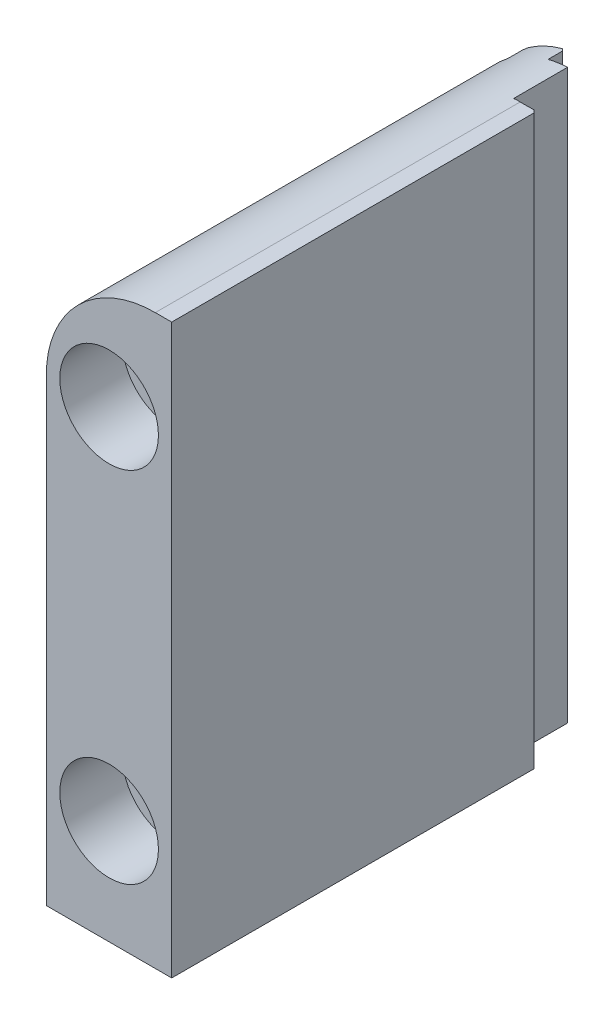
ISO-10303-21;
HEADER;
FILE_DESCRIPTION(('STEP AP214'),'2;1');
FILE_NAME('part.step','',(''),(''),'','','');
FILE_SCHEMA(('AUTOMOTIVE_DESIGN { 1 0 10303 214 1 1 1 1 }'));
ENDSEC;
DATA;
#1=APPLICATION_CONTEXT('core data for automotive mechanical design processes');
#2=APPLICATION_PROTOCOL_DEFINITION('international standard','automotive_design',2000,#1);
#3=PRODUCT_CONTEXT('',#1,'mechanical');
#4=PRODUCT('Part','Part','',(#3));
#5=PRODUCT_RELATED_PRODUCT_CATEGORY('part','',(#4));
#6=PRODUCT_DEFINITION_FORMATION('','',#4);
#7=PRODUCT_DEFINITION_CONTEXT('part definition',#1,'design');
#8=PRODUCT_DEFINITION('design','',#6,#7);
#9=PRODUCT_DEFINITION_SHAPE('','',#8);
#10=(LENGTH_UNIT() NAMED_UNIT(*) SI_UNIT(.MILLI.,.METRE.));
#11=(NAMED_UNIT(*) PLANE_ANGLE_UNIT() SI_UNIT($,.RADIAN.));
#12=(NAMED_UNIT(*) SI_UNIT($,.STERADIAN.) SOLID_ANGLE_UNIT());
#13=UNCERTAINTY_MEASURE_WITH_UNIT(LENGTH_MEASURE(1.E-05),#10,'distance_accuracy_value','');
#14=(GEOMETRIC_REPRESENTATION_CONTEXT(3) GLOBAL_UNCERTAINTY_ASSIGNED_CONTEXT((#13)) GLOBAL_UNIT_ASSIGNED_CONTEXT((#10,
#11,#12)) REPRESENTATION_CONTEXT('',''));
#15=CARTESIAN_POINT('',(0.,0.,0.));
#16=DIRECTION('',(0.,0.,1.));
#17=DIRECTION('',(1.,0.,0.));
#18=AXIS2_PLACEMENT_3D('',#15,#16,#17);
#19=CARTESIAN_POINT('',(-7.32028,25.146,-37.084));
#20=DIRECTION('',(0.,0.,-1.));
#21=DIRECTION('',(1.,0.,0.));
#22=AXIS2_PLACEMENT_3D('',#19,#20,#21);
#23=PLANE('',#22);
#24=CARTESIAN_POINT('',(-5.54228,-15.875,-37.084));
#25=DIRECTION('',(0.,0.,-1.));
#26=DIRECTION('',(-1.,0.,0.));
#27=AXIS2_PLACEMENT_3D('',#24,#25,#26);
#28=CIRCLE('',#27,2.7051);
#29=CARTESIAN_POINT('',(-8.24738,-15.875,-37.084));
#30=VERTEX_POINT('',#29);
#31=EDGE_CURVE('E319',#30,#30,#28,.T.);
#32=ORIENTED_EDGE('',*,*,#31,.F.);
#33=EDGE_LOOP('',(#32));
#34=FACE_BOUND('',#33,.T.);
#35=CARTESIAN_POINT('',(-5.54228,15.875,-37.084));
#36=DIRECTION('',(0.,0.,-1.));
#37=DIRECTION('',(-1.,0.,0.));
#38=AXIS2_PLACEMENT_3D('',#35,#36,#37);
#39=CIRCLE('',#38,2.7051);
#40=CARTESIAN_POINT('',(-8.24738,15.875,-37.084));
#41=VERTEX_POINT('',#40);
#42=EDGE_CURVE('E300',#41,#41,#39,.T.);
#43=ORIENTED_EDGE('',*,*,#42,.F.);
#44=EDGE_LOOP('',(#43));
#45=FACE_BOUND('',#44,.T.);
#46=DIRECTION('',(-0.999999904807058,0.000436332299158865,0.));
#47=VECTOR('',#46,1.);
#48=CARTESIAN_POINT('',(-7.32432489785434,15.8757775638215,-37.084));
#49=LINE('',#48,#47);
#50=CARTESIAN_POINT('',(-2.36702630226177,15.8736145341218,-37.084));
#51=VERTEX_POINT('',#50);
#52=CARTESIAN_POINT('',(-2.3672803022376,15.8736146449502,-37.084));
#53=VERTEX_POINT('',#52);
#54=EDGE_CURVE('E252',#51,#53,#49,.T.);
#55=ORIENTED_EDGE('',*,*,#54,.T.);
#56=CARTESIAN_POINT('',(-5.54228,15.875,-37.084));
#57=DIRECTION('',(0.,0.,1.));
#58=DIRECTION('',(1.,0.,0.));
#59=AXIS2_PLACEMENT_3D('',#56,#57,#58);
#60=CIRCLE('',#59,3.175);
#61=CARTESIAN_POINT('',(-2.36728,15.875,-37.084));
#62=VERTEX_POINT('',#61);
#63=EDGE_CURVE('E324',#62,#53,#60,.T.);
#64=ORIENTED_EDGE('',*,*,#63,.F.);
#65=DIRECTION('',(-1.,0.,0.));
#66=VECTOR('',#65,1.);
#67=CARTESIAN_POINT('',(-7.32028,15.875,-37.084));
#68=LINE('',#67,#66);
#69=CARTESIAN_POINT('',(-2.367026,15.875,-37.084));
#70=VERTEX_POINT('',#69);
#71=EDGE_CURVE('E381',#62,#70,#68,.F.);
#72=ORIENTED_EDGE('',*,*,#71,.T.);
#73=CARTESIAN_POINT('',(-5.54228,15.875,-37.084));
#74=DIRECTION('',(0.,0.,-1.));
#75=DIRECTION('',(-1.,0.,0.));
#76=AXIS2_PLACEMENT_3D('',#73,#74,#75);
#77=CIRCLE('',#76,3.175254);
#78=CARTESIAN_POINT('',(-3.76428,18.5057706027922,-37.084));
#79=VERTEX_POINT('',#78);
#80=EDGE_CURVE('E390',#79,#70,#77,.T.);
#81=ORIENTED_EDGE('',*,*,#80,.F.);
#82=DIRECTION('',(0.,-1.,0.));
#83=VECTOR('',#82,1.);
#84=CARTESIAN_POINT('',(-3.76428,25.146,-37.084));
#85=LINE('',#84,#83);
#86=CARTESIAN_POINT('',(-3.76428,24.8651543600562,-37.084));
#87=VERTEX_POINT('',#86);
#88=EDGE_CURVE('E261',#87,#79,#85,.T.);
#89=ORIENTED_EDGE('',*,*,#88,.F.);
#90=CARTESIAN_POINT('',(-1.45288,15.494,-37.084));
#91=DIRECTION('',(0.,0.,1.));
#92=DIRECTION('',(1.,0.,0.));
#93=AXIS2_PLACEMENT_3D('',#90,#91,#92);
#94=CIRCLE('',#93,9.652);
#95=CARTESIAN_POINT('',(-2.032,25.1286107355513,-37.084));
#96=VERTEX_POINT('',#95);
#97=EDGE_CURVE('E637',#96,#87,#94,.T.);
#98=ORIENTED_EDGE('',*,*,#97,.F.);
#99=DIRECTION('',(0.,-1.,0.));
#100=VECTOR('',#99,1.);
#101=CARTESIAN_POINT('',(-2.02438,25.146,-37.084));
#102=LINE('',#101,#100);
#103=CARTESIAN_POINT('',(-2.02438,-25.146,-37.084));
#104=VERTEX_POINT('',#103);
#105=EDGE_CURVE('E547',#96,#104,#102,.T.);
#106=ORIENTED_EDGE('',*,*,#105,.T.);
#107=DIRECTION('',(-1.,0.,0.));
#108=VECTOR('',#107,1.);
#109=CARTESIAN_POINT('',(-1.96088,-25.146,-37.084));
#110=LINE('',#109,#108);
#111=CARTESIAN_POINT('',(-3.76428,-25.146,-37.084));
#112=VERTEX_POINT('',#111);
#113=EDGE_CURVE('E310',#104,#112,#110,.T.);
#114=ORIENTED_EDGE('',*,*,#113,.T.);
#115=CARTESIAN_POINT('',(-3.76428,-18.5057706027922,-37.084));
#116=VERTEX_POINT('',#115);
#117=EDGE_CURVE('E262',#116,#112,#85,.T.);
#118=ORIENTED_EDGE('',*,*,#117,.F.);
#119=CARTESIAN_POINT('',(-5.54228,-15.875,-37.084));
#120=DIRECTION('',(0.,0.,-1.));
#121=DIRECTION('',(-1.,0.,0.));
#122=AXIS2_PLACEMENT_3D('',#119,#120,#121);
#123=CIRCLE('',#122,3.175254);
#124=CARTESIAN_POINT('',(-2.36702630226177,-15.8763854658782,-37.084));
#125=VERTEX_POINT('',#124);
#126=EDGE_CURVE('E359',#125,#116,#123,.T.);
#127=ORIENTED_EDGE('',*,*,#126,.F.);
#128=DIRECTION('',(-0.999999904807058,0.000436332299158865,0.));
#129=VECTOR('',#128,1.);
#130=CARTESIAN_POINT('',(-7.33817844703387,-15.874216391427,-37.084));
#131=LINE('',#130,#129);
#132=CARTESIAN_POINT('',(-2.3672803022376,-15.8763853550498,-37.084));
#133=VERTEX_POINT('',#132);
#134=EDGE_CURVE('E339',#125,#133,#131,.T.);
#135=ORIENTED_EDGE('',*,*,#134,.T.);
#136=CARTESIAN_POINT('',(-5.54228,-15.875,-37.084));
#137=DIRECTION('',(0.,0.,1.));
#138=DIRECTION('',(1.,0.,0.));
#139=AXIS2_PLACEMENT_3D('',#136,#137,#138);
#140=CIRCLE('',#139,3.175);
#141=CARTESIAN_POINT('',(-2.36728,-15.875,-37.084));
#142=VERTEX_POINT('',#141);
#143=EDGE_CURVE('E322',#142,#133,#140,.T.);
#144=ORIENTED_EDGE('',*,*,#143,.F.);
#145=DIRECTION('',(-1.,0.,0.));
#146=VECTOR('',#145,1.);
#147=CARTESIAN_POINT('',(-7.32028,-15.875,-37.084));
#148=LINE('',#147,#146);
#149=CARTESIAN_POINT('',(-2.367026,-15.875,-37.084));
#150=VERTEX_POINT('',#149);
#151=EDGE_CURVE('E336',#142,#150,#148,.F.);
#152=ORIENTED_EDGE('',*,*,#151,.T.);
#153=CARTESIAN_POINT('',(-3.76428,-13.2442293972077,-37.084));
#154=VERTEX_POINT('',#153);
#155=EDGE_CURVE('E342',#154,#150,#123,.T.);
#156=ORIENTED_EDGE('',*,*,#155,.F.);
#157=CARTESIAN_POINT('',(-3.76428,13.2442293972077,-37.084));
#158=VERTEX_POINT('',#157);
#159=EDGE_CURVE('E259',#158,#154,#85,.T.);
#160=ORIENTED_EDGE('',*,*,#159,.F.);
#161=EDGE_CURVE('E385',#51,#158,#77,.T.);
#162=ORIENTED_EDGE('',*,*,#161,.F.);
#163=EDGE_LOOP('',(#55,#64,#72,#81,#89,#98,#106,#114,#118,#127,#135,#144,#152,#156,#160,#162));
#164=FACE_BOUND('',#163,.T.);
#165=ADVANCED_FACE('F15',(#34,#45,#164),#23,.T.);
#166=CARTESIAN_POINT('',(-5.54228,15.875,-26.6446));
#167=DIRECTION('',(0.,0.,1.));
#168=DIRECTION('',(1.,0.,0.));
#169=AXIS2_PLACEMENT_3D('',#166,#167,#168);
#170=CONICAL_SURFACE('',#169,3.3147,0.785398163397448);
#171=CARTESIAN_POINT('',(-5.54228,15.875,-27.2542));
#172=DIRECTION('',(0.,0.,1.));
#173=DIRECTION('',(1.,0.,0.));
#174=AXIS2_PLACEMENT_3D('',#171,#172,#173);
#175=CIRCLE('',#174,2.7051);
#176=CARTESIAN_POINT('',(-2.83718,15.875,-27.2542));
#177=VERTEX_POINT('',#176);
#178=EDGE_CURVE('E568',#177,#177,#175,.T.);
#179=ORIENTED_EDGE('',*,*,#178,.F.);
#180=EDGE_LOOP('',(#179));
#181=FACE_BOUND('',#180,.T.);
#182=CARTESIAN_POINT('',(-5.54228,15.875,-26.6446));
#183=DIRECTION('',(0.,0.,-1.));
#184=DIRECTION('',(-1.,0.,0.));
#185=AXIS2_PLACEMENT_3D('',#182,#183,#184);
#186=CIRCLE('',#185,3.3147);
#187=CARTESIAN_POINT('',(-8.85698,15.875,-26.6446));
#188=VERTEX_POINT('',#187);
#189=EDGE_CURVE('E327',#188,#188,#186,.T.);
#190=ORIENTED_EDGE('',*,*,#189,.F.);
#191=EDGE_LOOP('',(#190));
#192=FACE_BOUND('',#191,.T.);
#193=CARTESIAN_POINT('',(-5.54228,15.875,-26.7843));
#194=DIRECTION('',(0.,0.,1.));
#195=DIRECTION('',(1.,0.,0.));
#196=AXIS2_PLACEMENT_3D('',#193,#194,#195);
#197=CIRCLE('',#196,3.175);
#198=CARTESIAN_POINT('',(-2.3672803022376,15.8736146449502,-26.7843));
#199=VERTEX_POINT('',#198);
#200=CARTESIAN_POINT('',(-2.36728,15.875,-26.7843));
#201=VERTEX_POINT('',#200);
#202=EDGE_CURVE('E9',#199,#201,#197,.F.);
#203=ORIENTED_EDGE('',*,*,#202,.F.);
#204=DIRECTION('',(0.707106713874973,-0.000308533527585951,0.707106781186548));
#205=VECTOR('',#204,1.);
#206=CARTESIAN_POINT('',(-5.54228,15.875,-29.9593));
#207=LINE('',#206,#205);
#208=CARTESIAN_POINT('',(-2.36702630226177,15.8736145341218,-26.784046));
#209=VERTEX_POINT('',#208);
#210=EDGE_CURVE('E244',#209,#199,#207,.F.);
#211=ORIENTED_EDGE('',*,*,#210,.F.);
#212=CARTESIAN_POINT('',(-5.54228,15.875,-26.784046));
#213=DIRECTION('',(0.,0.,1.));
#214=DIRECTION('',(1.,0.,0.));
#215=AXIS2_PLACEMENT_3D('',#212,#213,#214);
#216=CIRCLE('',#215,3.175254);
#217=CARTESIAN_POINT('',(-2.367026,15.875,-26.784046));
#218=VERTEX_POINT('',#217);
#219=EDGE_CURVE('E236',#209,#218,#216,.F.);
#220=ORIENTED_EDGE('',*,*,#219,.T.);
#221=DIRECTION('',(0.707106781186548,0.,0.707106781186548));
#222=VECTOR('',#221,1.);
#223=CARTESIAN_POINT('',(-5.54228,15.875,-29.9593));
#224=LINE('',#223,#222);
#225=EDGE_CURVE('E25',#201,#218,#224,.T.);
#226=ORIENTED_EDGE('',*,*,#225,.F.);
#227=EDGE_LOOP('',(#203,#211,#220,#226));
#228=FACE_BOUND('',#227,.T.);
#229=ADVANCED_FACE('F255',(#181,#192,#228),#170,.F.);
#230=CARTESIAN_POINT('',(-7.32028,13.2442293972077,-37.084));
#231=VERTEX_POINT('',#230);
#232=CARTESIAN_POINT('',(-7.32028,18.5057706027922,-37.084));
#233=VERTEX_POINT('',#232);
#234=EDGE_CURVE('E401',#231,#233,#77,.T.);
#235=ORIENTED_EDGE('',*,*,#234,.F.);
#236=DIRECTION('',(0.,-1.,0.));
#237=VECTOR('',#236,1.);
#238=CARTESIAN_POINT('',(-7.32028,25.146,-37.084));
#239=LINE('',#238,#237);
#240=CARTESIAN_POINT('',(-7.32028,-13.2442293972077,-37.084));
#241=VERTEX_POINT('',#240);
#242=EDGE_CURVE('E19',#231,#241,#239,.T.);
#243=ORIENTED_EDGE('',*,*,#242,.T.);
#244=CARTESIAN_POINT('',(-7.32028,-18.5057706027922,-37.084));
#245=VERTEX_POINT('',#244);
#246=EDGE_CURVE('E356',#245,#241,#123,.T.);
#247=ORIENTED_EDGE('',*,*,#246,.F.);
#248=CARTESIAN_POINT('',(-7.32028,-25.146,-37.084));
#249=VERTEX_POINT('',#248);
#250=EDGE_CURVE('E278',#245,#249,#239,.T.);
#251=ORIENTED_EDGE('',*,*,#250,.T.);
#252=DIRECTION('',(-1.,0.,0.));
#253=VECTOR('',#252,1.);
#254=CARTESIAN_POINT('',(-7.32028,-25.146,-37.084));
#255=LINE('',#254,#253);
#256=CARTESIAN_POINT('',(-11.10488,-25.146,-37.084));
#257=VERTEX_POINT('',#256);
#258=EDGE_CURVE('E296',#249,#257,#255,.T.);
#259=ORIENTED_EDGE('',*,*,#258,.T.);
#260=DIRECTION('',(0.,-1.,0.));
#261=VECTOR('',#260,1.);
#262=CARTESIAN_POINT('',(-11.10488,25.146,-37.084));
#263=LINE('',#262,#261);
#264=CARTESIAN_POINT('',(-11.10488,15.494,-37.084));
#265=VERTEX_POINT('',#264);
#266=EDGE_CURVE('E279',#265,#257,#263,.T.);
#267=ORIENTED_EDGE('',*,*,#266,.F.);
#268=CARTESIAN_POINT('',(-1.45288,15.494,-37.084));
#269=DIRECTION('',(0.,0.,1.));
#270=DIRECTION('',(1.,0.,0.));
#271=AXIS2_PLACEMENT_3D('',#268,#269,#270);
#272=CIRCLE('',#271,9.652);
#273=CARTESIAN_POINT('',(-7.32028,23.1578581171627,-37.084));
#274=VERTEX_POINT('',#273);
#275=EDGE_CURVE('E615',#274,#265,#272,.T.);
#276=ORIENTED_EDGE('',*,*,#275,.F.);
#277=EDGE_CURVE('E276',#274,#233,#239,.T.);
#278=ORIENTED_EDGE('',*,*,#277,.T.);
#279=EDGE_LOOP('',(#235,#243,#247,#251,#259,#267,#276,#278));
#280=FACE_BOUND('',#279,.T.);
#281=ADVANCED_FACE('F435',(#280),#23,.T.);
#282=CARTESIAN_POINT('',(-5.54228,-15.875,-26.6446));
#283=DIRECTION('',(0.,0.,1.));
#284=DIRECTION('',(1.,0.,0.));
#285=AXIS2_PLACEMENT_3D('',#282,#283,#284);
#286=CONICAL_SURFACE('',#285,3.3147,0.785398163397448);
#287=CARTESIAN_POINT('',(-5.54228,-15.875,-27.2542));
#288=DIRECTION('',(0.,0.,1.));
#289=DIRECTION('',(1.,0.,0.));
#290=AXIS2_PLACEMENT_3D('',#287,#288,#289);
#291=CIRCLE('',#290,2.7051);
#292=CARTESIAN_POINT('',(-2.83718,-15.875,-27.2542));
#293=VERTEX_POINT('',#292);
#294=EDGE_CURVE('E331',#293,#293,#291,.T.);
#295=ORIENTED_EDGE('',*,*,#294,.F.);
#296=EDGE_LOOP('',(#295));
#297=FACE_BOUND('',#296,.T.);
#298=CARTESIAN_POINT('',(-5.54228,-15.875,-26.6446));
#299=DIRECTION('',(0.,0.,-1.));
#300=DIRECTION('',(-1.,0.,0.));
#301=AXIS2_PLACEMENT_3D('',#298,#299,#300);
#302=CIRCLE('',#301,3.3147);
#303=CARTESIAN_POINT('',(-8.85698,-15.875,-26.6446));
#304=VERTEX_POINT('',#303);
#305=EDGE_CURVE('E332',#304,#304,#302,.T.);
#306=ORIENTED_EDGE('',*,*,#305,.F.);
#307=EDGE_LOOP('',(#306));
#308=FACE_BOUND('',#307,.T.);
#309=CARTESIAN_POINT('',(-5.54228,-15.875,-26.7843));
#310=DIRECTION('',(0.,0.,1.));
#311=DIRECTION('',(1.,0.,0.));
#312=AXIS2_PLACEMENT_3D('',#309,#310,#311);
#313=CIRCLE('',#312,3.175);
#314=CARTESIAN_POINT('',(-2.3672803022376,-15.8763853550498,-26.7843));
#315=VERTEX_POINT('',#314);
#316=CARTESIAN_POINT('',(-2.36728,-15.875,-26.7843));
#317=VERTEX_POINT('',#316);
#318=EDGE_CURVE('E245',#315,#317,#313,.F.);
#319=ORIENTED_EDGE('',*,*,#318,.F.);
#320=DIRECTION('',(0.707106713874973,-0.000308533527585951,0.707106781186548));
#321=VECTOR('',#320,1.);
#322=CARTESIAN_POINT('',(-5.54228,-15.875,-29.9593));
#323=LINE('',#322,#321);
#324=CARTESIAN_POINT('',(-2.36702630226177,-15.8763854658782,-26.784046));
#325=VERTEX_POINT('',#324);
#326=EDGE_CURVE('E576',#325,#315,#323,.F.);
#327=ORIENTED_EDGE('',*,*,#326,.F.);
#328=CARTESIAN_POINT('',(-5.54228,-15.875,-26.784046));
#329=DIRECTION('',(0.,0.,1.));
#330=DIRECTION('',(1.,0.,0.));
#331=AXIS2_PLACEMENT_3D('',#328,#329,#330);
#332=CIRCLE('',#331,3.175254);
#333=CARTESIAN_POINT('',(-2.367026,-15.875,-26.784046));
#334=VERTEX_POINT('',#333);
#335=EDGE_CURVE('E573',#325,#334,#332,.F.);
#336=ORIENTED_EDGE('',*,*,#335,.T.);
#337=DIRECTION('',(0.707106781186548,0.,0.707106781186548));
#338=VECTOR('',#337,1.);
#339=CARTESIAN_POINT('',(-5.54228,-15.875,-29.9593));
#340=LINE('',#339,#338);
#341=EDGE_CURVE('E578',#317,#334,#340,.T.);
#342=ORIENTED_EDGE('',*,*,#341,.F.);
#343=EDGE_LOOP('',(#319,#327,#336,#342));
#344=FACE_BOUND('',#343,.T.);
#345=ADVANCED_FACE('F446',(#297,#308,#344),#286,.F.);
#346=CARTESIAN_POINT('',(-3.76428,25.146,-37.084));
#347=DIRECTION('',(1.,0.,0.));
#348=DIRECTION('',(0.,0.,1.));
#349=AXIS2_PLACEMENT_3D('',#346,#347,#348);
#350=PLANE('',#349);
#351=DIRECTION('',(0.,0.,1.));
#352=VECTOR('',#351,1.);
#353=CARTESIAN_POINT('',(-3.76428,-18.5057706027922,-26.6446));
#354=LINE('',#353,#352);
#355=CARTESIAN_POINT('',(-3.76428,-18.5057706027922,-38.354));
#356=VERTEX_POINT('',#355);
#357=EDGE_CURVE('E361',#116,#356,#354,.F.);
#358=ORIENTED_EDGE('',*,*,#357,.F.);
#359=ORIENTED_EDGE('',*,*,#117,.T.);
#360=DIRECTION('',(0.,0.,-1.));
#361=VECTOR('',#360,1.);
#362=CARTESIAN_POINT('',(-3.76428,-25.146,-37.084));
#363=LINE('',#362,#361);
#364=CARTESIAN_POINT('',(-3.76428,-25.146,-38.354));
#365=VERTEX_POINT('',#364);
#366=EDGE_CURVE('E307',#112,#365,#363,.T.);
#367=ORIENTED_EDGE('',*,*,#366,.T.);
#368=DIRECTION('',(0.,1.,0.));
#369=VECTOR('',#368,1.);
#370=CARTESIAN_POINT('',(-3.76428,25.146,-38.354));
#371=LINE('',#370,#369);
#372=EDGE_CURVE('E490',#365,#356,#371,.T.);
#373=ORIENTED_EDGE('',*,*,#372,.T.);
#374=EDGE_LOOP('',(#358,#359,#367,#373));
#375=FACE_BOUND('',#374,.T.);
#376=ADVANCED_FACE('F450',(#375),#350,.T.);
#377=CARTESIAN_POINT('',(-7.32028,25.146,-38.354));
#378=DIRECTION('',(0.707106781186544,0.,0.707106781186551));
#379=DIRECTION('',(0.707106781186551,0.,-0.707106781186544));
#380=AXIS2_PLACEMENT_3D('',#377,#378,#379);
#381=PLANE('',#380);
#382=CARTESIAN_POINT('',(-5.54228,-15.875,-40.132));
#383=DIRECTION('',(0.707106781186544,0.,0.707106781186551));
#384=DIRECTION('',(-0.707106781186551,0.,0.707106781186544));
#385=AXIS2_PLACEMENT_3D('',#382,#383,#384);
#386=ELLIPSE('',#385,4.4904872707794,3.175254);
#387=CARTESIAN_POINT('',(-7.06628,-18.6606169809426,-38.608));
#388=VERTEX_POINT('',#387);
#389=CARTESIAN_POINT('',(-7.32028,-18.5057706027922,-38.354));
#390=VERTEX_POINT('',#389);
#391=EDGE_CURVE('E363',#388,#390,#386,.F.);
#392=ORIENTED_EDGE('',*,*,#391,.F.);
#393=DIRECTION('',(0.,1.,0.));
#394=VECTOR('',#393,1.);
#395=CARTESIAN_POINT('',(-7.06628,25.146,-38.608));
#396=LINE('',#395,#394);
#397=CARTESIAN_POINT('',(-7.06628,-25.146,-38.608));
#398=VERTEX_POINT('',#397);
#399=EDGE_CURVE('E477',#398,#388,#396,.T.);
#400=ORIENTED_EDGE('',*,*,#399,.F.);
#401=DIRECTION('',(-0.707106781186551,0.,0.707106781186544));
#402=VECTOR('',#401,1.);
#403=CARTESIAN_POINT('',(-7.32028,-25.146,-38.354));
#404=LINE('',#403,#402);
#405=CARTESIAN_POINT('',(-7.32028,-25.146,-38.354));
#406=VERTEX_POINT('',#405);
#407=EDGE_CURVE('E516',#406,#398,#404,.F.);
#408=ORIENTED_EDGE('',*,*,#407,.F.);
#409=DIRECTION('',(0.,-1.,0.));
#410=VECTOR('',#409,1.);
#411=CARTESIAN_POINT('',(-7.32028,25.146,-38.354));
#412=LINE('',#411,#410);
#413=EDGE_CURVE('E513',#390,#406,#412,.T.);
#414=ORIENTED_EDGE('',*,*,#413,.F.);
#415=EDGE_LOOP('',(#392,#400,#408,#414));
#416=FACE_BOUND('',#415,.T.);
#417=ADVANCED_FACE('F607',(#416),#381,.F.);
#418=CARTESIAN_POINT('',(-3.76428,25.146,-38.608));
#419=DIRECTION('',(0.,0.,-1.));
#420=DIRECTION('',(1.,0.,0.));
#421=AXIS2_PLACEMENT_3D('',#418,#419,#420);
#422=PLANE('',#421);
#423=CARTESIAN_POINT('',(-5.54228,15.875,-38.608));
#424=DIRECTION('',(0.,0.,-1.));
#425=DIRECTION('',(-1.,0.,0.));
#426=AXIS2_PLACEMENT_3D('',#423,#424,#425);
#427=CIRCLE('',#426,3.175254);
#428=CARTESIAN_POINT('',(-4.01828,13.0893830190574,-38.608));
#429=VERTEX_POINT('',#428);
#430=CARTESIAN_POINT('',(-7.06628,13.0893830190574,-38.608));
#431=VERTEX_POINT('',#430);
#432=EDGE_CURVE('E391',#429,#431,#427,.T.);
#433=ORIENTED_EDGE('',*,*,#432,.F.);
#434=DIRECTION('',(0.,-1.,0.));
#435=VECTOR('',#434,1.);
#436=CARTESIAN_POINT('',(-4.01828,25.146,-38.608));
#437=LINE('',#436,#435);
#438=CARTESIAN_POINT('',(-4.01828,-13.0893830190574,-38.608));
#439=VERTEX_POINT('',#438);
#440=EDGE_CURVE('E522',#429,#439,#437,.T.);
#441=ORIENTED_EDGE('',*,*,#440,.T.);
#442=CARTESIAN_POINT('',(-5.54228,-15.875,-38.608));
#443=DIRECTION('',(0.,0.,-1.));
#444=DIRECTION('',(-1.,0.,0.));
#445=AXIS2_PLACEMENT_3D('',#442,#443,#444);
#446=CIRCLE('',#445,3.175254);
#447=CARTESIAN_POINT('',(-7.06628,-13.0893830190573,-38.608));
#448=VERTEX_POINT('',#447);
#449=EDGE_CURVE('E348',#448,#439,#446,.T.);
#450=ORIENTED_EDGE('',*,*,#449,.F.);
#451=EDGE_CURVE('E474',#448,#431,#396,.T.);
#452=ORIENTED_EDGE('',*,*,#451,.T.);
#453=EDGE_LOOP('',(#433,#441,#450,#452));
#454=FACE_BOUND('',#453,.T.);
#455=ADVANCED_FACE('F936',(#454),#422,.T.);
#456=CARTESIAN_POINT('',(-7.32028,25.146,-38.608));
#457=DIRECTION('',(-1.,0.,0.));
#458=DIRECTION('',(0.,0.,-1.));
#459=AXIS2_PLACEMENT_3D('',#456,#457,#458);
#460=PLANE('',#459);
#461=DIRECTION('',(0.,0.,1.));
#462=VECTOR('',#461,1.);
#463=CARTESIAN_POINT('',(-7.32028,13.2442293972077,-26.6446));
#464=LINE('',#463,#462);
#465=CARTESIAN_POINT('',(-7.32028,13.2442293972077,-38.354));
#466=VERTEX_POINT('',#465);
#467=EDGE_CURVE('E397',#466,#231,#464,.T.);
#468=ORIENTED_EDGE('',*,*,#467,.F.);
#469=CARTESIAN_POINT('',(-7.32028,-13.2442293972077,-38.354));
#470=VERTEX_POINT('',#469);
#471=EDGE_CURVE('E464',#466,#470,#412,.T.);
#472=ORIENTED_EDGE('',*,*,#471,.T.);
#473=DIRECTION('',(0.,0.,1.));
#474=VECTOR('',#473,1.);
#475=CARTESIAN_POINT('',(-7.32028,-13.2442293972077,-26.6446));
#476=LINE('',#475,#474);
#477=EDGE_CURVE('E353',#241,#470,#476,.F.);
#478=ORIENTED_EDGE('',*,*,#477,.F.);
#479=ORIENTED_EDGE('',*,*,#242,.F.);
#480=EDGE_LOOP('',(#468,#472,#478,#479));
#481=FACE_BOUND('',#480,.T.);
#482=ADVANCED_FACE('F462',(#481),#460,.T.);
#483=CARTESIAN_POINT('',(-4.01828,25.146,-38.608));
#484=DIRECTION('',(-0.707106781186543,0.,0.707106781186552));
#485=DIRECTION('',(0.707106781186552,0.,0.707106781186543));
#486=AXIS2_PLACEMENT_3D('',#483,#484,#485);
#487=PLANE('',#486);
#488=CARTESIAN_POINT('',(-5.54228,15.875,-40.132));
#489=DIRECTION('',(-0.707106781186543,0.,0.707106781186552));
#490=DIRECTION('',(0.707106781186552,0.,0.707106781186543));
#491=AXIS2_PLACEMENT_3D('',#488,#489,#490);
#492=ELLIPSE('',#491,4.4904872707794,3.175254);
#493=CARTESIAN_POINT('',(-3.76428,13.2442293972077,-38.354));
#494=VERTEX_POINT('',#493);
#495=EDGE_CURVE('E388',#494,#429,#492,.F.);
#496=ORIENTED_EDGE('',*,*,#495,.F.);
#497=CARTESIAN_POINT('',(-3.76428,-13.2442293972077,-38.354));
#498=VERTEX_POINT('',#497);
#499=EDGE_CURVE('E493',#498,#494,#371,.T.);
#500=ORIENTED_EDGE('',*,*,#499,.F.);
#501=CARTESIAN_POINT('',(-5.54228,-15.875,-40.132));
#502=DIRECTION('',(-0.707106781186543,0.,0.707106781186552));
#503=DIRECTION('',(0.707106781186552,0.,0.707106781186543));
#504=AXIS2_PLACEMENT_3D('',#501,#502,#503);
#505=ELLIPSE('',#504,4.4904872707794,3.175254);
#506=EDGE_CURVE('E346',#439,#498,#505,.F.);
#507=ORIENTED_EDGE('',*,*,#506,.F.);
#508=ORIENTED_EDGE('',*,*,#440,.F.);
#509=EDGE_LOOP('',(#496,#500,#507,#508));
#510=FACE_BOUND('',#509,.T.);
#511=ADVANCED_FACE('F715',(#510),#487,.F.);
#512=DIRECTION('',(0.,0.,1.));
#513=VECTOR('',#512,1.);
#514=CARTESIAN_POINT('',(-3.76428,13.2442293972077,-26.6446));
#515=LINE('',#514,#513);
#516=EDGE_CURVE('E386',#158,#494,#515,.F.);
#517=ORIENTED_EDGE('',*,*,#516,.F.);
#518=ORIENTED_EDGE('',*,*,#159,.T.);
#519=DIRECTION('',(0.,0.,1.));
#520=VECTOR('',#519,1.);
#521=CARTESIAN_POINT('',(-3.76428,-13.2442293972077,-26.6446));
#522=LINE('',#521,#520);
#523=EDGE_CURVE('E343',#498,#154,#522,.T.);
#524=ORIENTED_EDGE('',*,*,#523,.F.);
#525=ORIENTED_EDGE('',*,*,#499,.T.);
#526=EDGE_LOOP('',(#517,#518,#524,#525));
#527=FACE_BOUND('',#526,.T.);
#528=ADVANCED_FACE('F944',(#527),#350,.T.);
#529=CARTESIAN_POINT('',(-5.54228,15.875,-38.608));
#530=DIRECTION('',(0.,0.,-1.));
#531=DIRECTION('',(-1.,0.,0.));
#532=AXIS2_PLACEMENT_3D('',#529,#530,#531);
#533=CIRCLE('',#532,3.175254);
#534=CARTESIAN_POINT('',(-7.06628,18.6606169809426,-38.608));
#535=VERTEX_POINT('',#534);
#536=CARTESIAN_POINT('',(-4.01828,18.6606169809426,-38.608));
#537=VERTEX_POINT('',#536);
#538=EDGE_CURVE('E403',#535,#537,#533,.T.);
#539=ORIENTED_EDGE('',*,*,#538,.F.);
#540=CARTESIAN_POINT('',(-7.06628,23.3458051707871,-38.608));
#541=VERTEX_POINT('',#540);
#542=EDGE_CURVE('E478',#535,#541,#396,.T.);
#543=ORIENTED_EDGE('',*,*,#542,.T.);
#544=CARTESIAN_POINT('',(-1.45288,15.494,-38.608));
#545=DIRECTION('',(0.,0.,1.));
#546=DIRECTION('',(1.,0.,0.));
#547=AXIS2_PLACEMENT_3D('',#544,#545,#546);
#548=CIRCLE('',#547,9.652);
#549=CARTESIAN_POINT('',(-4.01828,24.7988281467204,-38.608));
#550=VERTEX_POINT('',#549);
#551=EDGE_CURVE('E535',#550,#541,#548,.T.);
#552=ORIENTED_EDGE('',*,*,#551,.F.);
#553=EDGE_CURVE('E482',#550,#537,#437,.T.);
#554=ORIENTED_EDGE('',*,*,#553,.T.);
#555=EDGE_LOOP('',(#539,#543,#552,#554));
#556=FACE_BOUND('',#555,.T.);
#557=ADVANCED_FACE('F532',(#556),#422,.T.);
#558=DIRECTION('',(0.,0.,1.));
#559=VECTOR('',#558,1.);
#560=CARTESIAN_POINT('',(-7.32028,18.5057706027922,-26.6446));
#561=LINE('',#560,#559);
#562=CARTESIAN_POINT('',(-7.32028,18.5057706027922,-38.354));
#563=VERTEX_POINT('',#562);
#564=EDGE_CURVE('E33',#233,#563,#561,.F.);
#565=ORIENTED_EDGE('',*,*,#564,.F.);
#566=ORIENTED_EDGE('',*,*,#277,.F.);
#567=DIRECTION('',(0.,0.,1.));
#568=VECTOR('',#567,1.);
#569=CARTESIAN_POINT('',(-7.32028,23.1578581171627,-38.608));
#570=LINE('',#569,#568);
#571=CARTESIAN_POINT('',(-7.32028,23.1578581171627,-38.354));
#572=VERTEX_POINT('',#571);
#573=EDGE_CURVE('E623',#572,#274,#570,.T.);
#574=ORIENTED_EDGE('',*,*,#573,.F.);
#575=EDGE_CURVE('E509',#572,#563,#412,.T.);
#576=ORIENTED_EDGE('',*,*,#575,.T.);
#577=EDGE_LOOP('',(#565,#566,#574,#576));
#578=FACE_BOUND('',#577,.T.);
#579=ADVANCED_FACE('F727',(#578),#460,.T.);
#580=CARTESIAN_POINT('',(-5.54228,15.875,-40.132));
#581=DIRECTION('',(0.707106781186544,0.,0.707106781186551));
#582=DIRECTION('',(-0.707106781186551,0.,0.707106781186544));
#583=AXIS2_PLACEMENT_3D('',#580,#581,#582);
#584=ELLIPSE('',#583,4.4904872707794,3.175254);
#585=EDGE_CURVE('E393',#431,#466,#584,.F.);
#586=ORIENTED_EDGE('',*,*,#585,.F.);
#587=ORIENTED_EDGE('',*,*,#451,.F.);
#588=CARTESIAN_POINT('',(-5.54228,-15.875,-40.132));
#589=DIRECTION('',(0.707106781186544,0.,0.707106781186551));
#590=DIRECTION('',(-0.707106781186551,0.,0.707106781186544));
#591=AXIS2_PLACEMENT_3D('',#588,#589,#590);
#592=ELLIPSE('',#591,4.4904872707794,3.175254);
#593=EDGE_CURVE('E351',#470,#448,#592,.F.);
#594=ORIENTED_EDGE('',*,*,#593,.F.);
#595=ORIENTED_EDGE('',*,*,#471,.F.);
#596=EDGE_LOOP('',(#586,#587,#594,#595));
#597=FACE_BOUND('',#596,.T.);
#598=ADVANCED_FACE('F472',(#597),#381,.F.);
#599=CARTESIAN_POINT('',(-5.54228,15.875,-40.132));
#600=DIRECTION('',(-0.707106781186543,0.,0.707106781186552));
#601=DIRECTION('',(0.707106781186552,0.,0.707106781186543));
#602=AXIS2_PLACEMENT_3D('',#599,#600,#601);
#603=ELLIPSE('',#602,4.4904872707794,3.175254);
#604=CARTESIAN_POINT('',(-3.76428,18.5057706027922,-38.354));
#605=VERTEX_POINT('',#604);
#606=EDGE_CURVE('E399',#537,#605,#603,.F.);
#607=ORIENTED_EDGE('',*,*,#606,.F.);
#608=ORIENTED_EDGE('',*,*,#553,.F.);
#609=CARTESIAN_POINT('',(-1.45288,15.494,-36.0426));
#610=DIRECTION('',(-0.707106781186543,0.,0.707106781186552));
#611=DIRECTION('',(0.707106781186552,0.,0.707106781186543));
#612=AXIS2_PLACEMENT_3D('',#609,#610,#611);
#613=ELLIPSE('',#612,13.649989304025,9.652);
#614=CARTESIAN_POINT('',(-3.76428,24.8651543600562,-38.354));
#615=VERTEX_POINT('',#614);
#616=EDGE_CURVE('E481',#615,#550,#613,.T.);
#617=ORIENTED_EDGE('',*,*,#616,.F.);
#618=EDGE_CURVE('E489',#605,#615,#371,.T.);
#619=ORIENTED_EDGE('',*,*,#618,.F.);
#620=EDGE_LOOP('',(#607,#608,#617,#619));
#621=FACE_BOUND('',#620,.T.);
#622=ADVANCED_FACE('F539',(#621),#487,.F.);
#623=CARTESIAN_POINT('',(-11.10488,25.146,-37.084));
#624=DIRECTION('',(-1.,0.,0.));
#625=DIRECTION('',(0.,0.,-1.));
#626=AXIS2_PLACEMENT_3D('',#623,#624,#625);
#627=PLANE('',#626);
#628=DIRECTION('',(0.,0.,1.));
#629=VECTOR('',#628,1.);
#630=CARTESIAN_POINT('',(-11.10488,15.494,-37.084));
#631=LINE('',#630,#629);
#632=CARTESIAN_POINT('',(-11.10488,15.494,0.));
#633=VERTEX_POINT('',#632);
#634=EDGE_CURVE('E620',#265,#633,#631,.T.);
#635=ORIENTED_EDGE('',*,*,#634,.F.);
#636=ORIENTED_EDGE('',*,*,#266,.T.);
#637=DIRECTION('',(0.,0.,1.));
#638=VECTOR('',#637,1.);
#639=CARTESIAN_POINT('',(-11.10488,-25.146,-37.084));
#640=LINE('',#639,#638);
#641=CARTESIAN_POINT('',(-11.10488,-25.146,0.));
#642=VERTEX_POINT('',#641);
#643=EDGE_CURVE('E297',#257,#642,#640,.T.);
#644=ORIENTED_EDGE('',*,*,#643,.T.);
#645=DIRECTION('',(0.,-1.,0.));
#646=VECTOR('',#645,1.);
#647=CARTESIAN_POINT('',(-11.10488,25.146,0.));
#648=LINE('',#647,#646);
#649=EDGE_CURVE('E267',#633,#642,#648,.T.);
#650=ORIENTED_EDGE('',*,*,#649,.F.);
#651=EDGE_LOOP('',(#635,#636,#644,#650));
#652=FACE_BOUND('',#651,.T.);
#653=ADVANCED_FACE('F625',(#652),#627,.T.);
#654=CARTESIAN_POINT('',(-11.10488,25.146,0.));
#655=DIRECTION('',(0.,0.,1.));
#656=DIRECTION('',(-1.,0.,0.));
#657=AXIS2_PLACEMENT_3D('',#654,#655,#656);
#658=PLANE('',#657);
#659=CARTESIAN_POINT('',(-5.54228,-15.875,0.));
#660=DIRECTION('',(0.,0.,1.));
#661=DIRECTION('',(1.,0.,0.));
#662=AXIS2_PLACEMENT_3D('',#659,#660,#661);
#663=CIRCLE('',#662,4.365625);
#664=CARTESIAN_POINT('',(-1.176655,-15.875,0.));
#665=VERTEX_POINT('',#664);
#666=EDGE_CURVE('E565',#665,#665,#663,.F.);
#667=ORIENTED_EDGE('',*,*,#666,.T.);
#668=EDGE_LOOP('',(#667));
#669=FACE_BOUND('',#668,.T.);
#670=CARTESIAN_POINT('',(-5.54228,15.875,0.));
#671=DIRECTION('',(0.,0.,1.));
#672=DIRECTION('',(1.,0.,0.));
#673=AXIS2_PLACEMENT_3D('',#670,#671,#672);
#674=CIRCLE('',#673,4.365625);
#675=CARTESIAN_POINT('',(-1.176655,15.875,0.));
#676=VERTEX_POINT('',#675);
#677=EDGE_CURVE('E564',#676,#676,#674,.F.);
#678=ORIENTED_EDGE('',*,*,#677,.T.);
#679=EDGE_LOOP('',(#678));
#680=FACE_BOUND('',#679,.T.);
#681=ORIENTED_EDGE('',*,*,#649,.T.);
#682=DIRECTION('',(1.,0.,0.));
#683=VECTOR('',#682,1.);
#684=CARTESIAN_POINT('',(-11.10488,-25.146,0.));
#685=LINE('',#684,#683);
#686=CARTESIAN_POINT('',(0.,-25.146,0.));
#687=VERTEX_POINT('',#686);
#688=EDGE_CURVE('E299',#642,#687,#685,.T.);
#689=ORIENTED_EDGE('',*,*,#688,.T.);
#690=DIRECTION('',(0.,-1.,0.));
#691=VECTOR('',#690,1.);
#692=CARTESIAN_POINT('',(0.,25.146,0.));
#693=LINE('',#692,#691);
#694=CARTESIAN_POINT('',(0.,25.146,0.));
#695=VERTEX_POINT('',#694);
#696=EDGE_CURVE('E553',#695,#687,#693,.T.);
#697=ORIENTED_EDGE('',*,*,#696,.F.);
#698=DIRECTION('',(1.,0.,0.));
#699=VECTOR('',#698,1.);
#700=CARTESIAN_POINT('',(-11.10488,25.146,0.));
#701=LINE('',#700,#699);
#702=CARTESIAN_POINT('',(-1.45288,25.146,0.));
#703=VERTEX_POINT('',#702);
#704=EDGE_CURVE('E293',#703,#695,#701,.T.);
#705=ORIENTED_EDGE('',*,*,#704,.F.);
#706=CARTESIAN_POINT('',(-1.45288,15.494,0.));
#707=DIRECTION('',(0.,0.,-1.));
#708=DIRECTION('',(-1.,0.,0.));
#709=AXIS2_PLACEMENT_3D('',#706,#707,#708);
#710=CIRCLE('',#709,9.652);
#711=EDGE_CURVE('E627',#633,#703,#710,.T.);
#712=ORIENTED_EDGE('',*,*,#711,.F.);
#713=EDGE_LOOP('',(#681,#689,#697,#705,#712));
#714=FACE_BOUND('',#713,.T.);
#715=ADVANCED_FACE('F732',(#669,#680,#714),#658,.T.);
#716=CARTESIAN_POINT('',(0.,25.146,0.));
#717=DIRECTION('',(1.,0.,0.));
#718=DIRECTION('',(0.,0.,1.));
#719=AXIS2_PLACEMENT_3D('',#716,#717,#718);
#720=PLANE('',#719);
#721=DIRECTION('',(0.,0.,-1.));
#722=VECTOR('',#721,1.);
#723=CARTESIAN_POINT('',(0.,-25.146,-32.29356));
#724=LINE('',#723,#722);
#725=CARTESIAN_POINT('',(0.,-25.146,-32.0548));
#726=VERTEX_POINT('',#725);
#727=EDGE_CURVE('E316',#687,#726,#724,.T.);
#728=ORIENTED_EDGE('',*,*,#727,.T.);
#729=DIRECTION('',(0.,1.,0.));
#730=VECTOR('',#729,1.);
#731=CARTESIAN_POINT('',(0.,25.146,-32.0548));
#732=LINE('',#731,#730);
#733=CARTESIAN_POINT('',(0.,25.146,-32.0548));
#734=VERTEX_POINT('',#733);
#735=EDGE_CURVE('E665',#726,#734,#732,.T.);
#736=ORIENTED_EDGE('',*,*,#735,.T.);
#737=DIRECTION('',(0.,0.,-1.));
#738=VECTOR('',#737,1.);
#739=CARTESIAN_POINT('',(0.,25.146,-32.29356));
#740=LINE('',#739,#738);
#741=EDGE_CURVE('E290',#695,#734,#740,.T.);
#742=ORIENTED_EDGE('',*,*,#741,.F.);
#743=ORIENTED_EDGE('',*,*,#696,.T.);
#744=EDGE_LOOP('',(#728,#736,#742,#743));
#745=FACE_BOUND('',#744,.T.);
#746=ADVANCED_FACE('F730',(#745),#720,.T.);
#747=CARTESIAN_POINT('',(0.00380999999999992,25.146,-32.3088));
#748=DIRECTION('',(0.,0.,-1.));
#749=DIRECTION('',(1.,0.,0.));
#750=AXIS2_PLACEMENT_3D('',#747,#748,#749);
#751=PLANE('',#750);
#752=DIRECTION('',(-1.,0.,0.));
#753=VECTOR('',#752,1.);
#754=CARTESIAN_POINT('',(-11.10488,25.146,-32.3088));
#755=LINE('',#754,#753);
#756=CARTESIAN_POINT('',(-0.254,25.146,-32.3088));
#757=VERTEX_POINT('',#756);
#758=CARTESIAN_POINT('',(-1.45288,25.146,-32.29356));
#759=VERTEX_POINT('',#758);
#760=EDGE_CURVE('E285',#757,#759,#755,.T.);
#761=ORIENTED_EDGE('',*,*,#760,.F.);
#762=DIRECTION('',(0.,-1.,0.));
#763=VECTOR('',#762,1.);
#764=CARTESIAN_POINT('',(-0.254,25.146,-32.3088));
#765=LINE('',#764,#763);
#766=CARTESIAN_POINT('',(-0.254,-25.146,-32.3088));
#767=VERTEX_POINT('',#766);
#768=EDGE_CURVE('E492',#757,#767,#765,.T.);
#769=ORIENTED_EDGE('',*,*,#768,.T.);
#770=DIRECTION('',(-1.,0.,0.));
#771=VECTOR('',#770,1.);
#772=CARTESIAN_POINT('',(-11.10488,-25.146,-32.3088));
#773=LINE('',#772,#771);
#774=CARTESIAN_POINT('',(-2.02438,-25.146,-32.3088));
#775=VERTEX_POINT('',#774);
#776=EDGE_CURVE('E500',#767,#775,#773,.T.);
#777=ORIENTED_EDGE('',*,*,#776,.T.);
#778=DIRECTION('',(0.,-1.,0.));
#779=VECTOR('',#778,1.);
#780=CARTESIAN_POINT('',(-2.02438,25.146,-32.3088));
#781=LINE('',#780,#779);
#782=CARTESIAN_POINT('',(-2.02438,25.1286107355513,-32.29356));
#783=VERTEX_POINT('',#782);
#784=EDGE_CURVE('E548',#783,#775,#781,.T.);
#785=ORIENTED_EDGE('',*,*,#784,.F.);
#786=CARTESIAN_POINT('',(-1.45288,15.494,-32.3088));
#787=DIRECTION('',(0.,0.,-1.));
#788=DIRECTION('',(-1.,0.,0.));
#789=AXIS2_PLACEMENT_3D('',#786,#787,#788);
#790=CIRCLE('',#789,9.652);
#791=EDGE_CURVE('E502',#759,#783,#790,.F.);
#792=ORIENTED_EDGE('',*,*,#791,.F.);
#793=EDGE_LOOP('',(#761,#769,#777,#785,#792));
#794=FACE_BOUND('',#793,.T.);
#795=ADVANCED_FACE('F655',(#794),#751,.T.);
#796=CARTESIAN_POINT('',(-2.02438,25.146,-32.29356));
#797=DIRECTION('',(1.,0.,0.));
#798=DIRECTION('',(0.,0.,1.));
#799=AXIS2_PLACEMENT_3D('',#796,#797,#798);
#800=PLANE('',#799);
#801=DIRECTION('',(0.,0.,-1.));
#802=VECTOR('',#801,1.);
#803=CARTESIAN_POINT('',(-2.02438,-25.146,-32.29356));
#804=LINE('',#803,#802);
#805=EDGE_CURVE('E313',#775,#104,#804,.T.);
#806=ORIENTED_EDGE('',*,*,#805,.T.);
#807=ORIENTED_EDGE('',*,*,#105,.F.);
#808=DIRECTION('',(0.,0.,1.));
#809=VECTOR('',#808,1.);
#810=CARTESIAN_POINT('',(-2.02438,25.1290657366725,-32.29356));
#811=LINE('',#810,#809);
#812=EDGE_CURVE('E505',#783,#96,#811,.F.);
#813=ORIENTED_EDGE('',*,*,#812,.F.);
#814=ORIENTED_EDGE('',*,*,#784,.T.);
#815=EDGE_LOOP('',(#806,#807,#813,#814));
#816=FACE_BOUND('',#815,.T.);
#817=ADVANCED_FACE('F658',(#816),#800,.T.);
#818=DIRECTION('',(0.,0.,1.));
#819=VECTOR('',#818,1.);
#820=CARTESIAN_POINT('',(-3.76428,18.5057706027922,-26.6446));
#821=LINE('',#820,#819);
#822=EDGE_CURVE('E395',#605,#79,#821,.T.);
#823=ORIENTED_EDGE('',*,*,#822,.F.);
#824=ORIENTED_EDGE('',*,*,#618,.T.);
#825=DIRECTION('',(0.,0.,1.));
#826=VECTOR('',#825,1.);
#827=CARTESIAN_POINT('',(-3.76428,24.8651543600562,-37.084));
#828=LINE('',#827,#826);
#829=EDGE_CURVE('E545',#87,#615,#828,.F.);
#830=ORIENTED_EDGE('',*,*,#829,.F.);
#831=ORIENTED_EDGE('',*,*,#88,.T.);
#832=EDGE_LOOP('',(#823,#824,#830,#831));
#833=FACE_BOUND('',#832,.T.);
#834=ADVANCED_FACE('F543',(#833),#350,.T.);
#835=CARTESIAN_POINT('',(-5.54228,-15.875,-38.608));
#836=DIRECTION('',(0.,0.,-1.));
#837=DIRECTION('',(-1.,0.,0.));
#838=AXIS2_PLACEMENT_3D('',#835,#836,#837);
#839=CIRCLE('',#838,3.175254);
#840=CARTESIAN_POINT('',(-4.01828,-18.6606169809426,-38.608));
#841=VERTEX_POINT('',#840);
#842=EDGE_CURVE('E365',#841,#388,#839,.T.);
#843=ORIENTED_EDGE('',*,*,#842,.F.);
#844=CARTESIAN_POINT('',(-4.01828,-25.146,-38.608));
#845=VERTEX_POINT('',#844);
#846=EDGE_CURVE('E517',#841,#845,#437,.T.);
#847=ORIENTED_EDGE('',*,*,#846,.T.);
#848=DIRECTION('',(-1.,0.,0.));
#849=VECTOR('',#848,1.);
#850=CARTESIAN_POINT('',(-3.76428,-25.146,-38.608));
#851=LINE('',#850,#849);
#852=EDGE_CURVE('E304',#845,#398,#851,.T.);
#853=ORIENTED_EDGE('',*,*,#852,.T.);
#854=ORIENTED_EDGE('',*,*,#399,.T.);
#855=EDGE_LOOP('',(#843,#847,#853,#854));
#856=FACE_BOUND('',#855,.T.);
#857=ADVANCED_FACE('F604',(#856),#422,.T.);
#858=DIRECTION('',(0.,0.,1.));
#859=VECTOR('',#858,1.);
#860=CARTESIAN_POINT('',(-7.32028,-18.5057706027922,-26.6446));
#861=LINE('',#860,#859);
#862=EDGE_CURVE('E357',#390,#245,#861,.T.);
#863=ORIENTED_EDGE('',*,*,#862,.F.);
#864=ORIENTED_EDGE('',*,*,#413,.T.);
#865=DIRECTION('',(0.,0.,1.));
#866=VECTOR('',#865,1.);
#867=CARTESIAN_POINT('',(-7.32028,-25.146,-38.608));
#868=LINE('',#867,#866);
#869=EDGE_CURVE('E302',#406,#249,#868,.T.);
#870=ORIENTED_EDGE('',*,*,#869,.T.);
#871=ORIENTED_EDGE('',*,*,#250,.F.);
#872=EDGE_LOOP('',(#863,#864,#870,#871));
#873=FACE_BOUND('',#872,.T.);
#874=ADVANCED_FACE('F611',(#873),#460,.T.);
#875=CARTESIAN_POINT('',(-11.10488,25.146,-32.29356));
#876=DIRECTION('',(0.,1.,0.));
#877=DIRECTION('',(0.,0.,1.));
#878=AXIS2_PLACEMENT_3D('',#875,#876,#877);
#879=PLANE('',#878);
#880=ORIENTED_EDGE('',*,*,#741,.T.);
#881=DIRECTION('',(0.707106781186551,0.,0.707106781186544));
#882=VECTOR('',#881,1.);
#883=CARTESIAN_POINT('',(-5.67182,25.146,-37.72662));
#884=LINE('',#883,#882);
#885=EDGE_CURVE('E577',#734,#757,#884,.F.);
#886=ORIENTED_EDGE('',*,*,#885,.T.);
#887=ORIENTED_EDGE('',*,*,#760,.T.);
#888=DIRECTION('',(0.,0.,1.));
#889=VECTOR('',#888,1.);
#890=CARTESIAN_POINT('',(-1.45288,25.146,-32.29356));
#891=LINE('',#890,#889);
#892=EDGE_CURVE('E506',#703,#759,#891,.F.);
#893=ORIENTED_EDGE('',*,*,#892,.F.);
#894=ORIENTED_EDGE('',*,*,#704,.T.);
#895=EDGE_LOOP('',(#880,#886,#887,#893,#894));
#896=FACE_BOUND('',#895,.T.);
#897=ADVANCED_FACE('F722',(#896),#879,.T.);
#898=CARTESIAN_POINT('',(-11.10488,-25.146,-32.29356));
#899=DIRECTION('',(0.,1.,0.));
#900=DIRECTION('',(0.,0.,1.));
#901=AXIS2_PLACEMENT_3D('',#898,#899,#900);
#902=PLANE('',#901);
#903=ORIENTED_EDGE('',*,*,#869,.F.);
#904=ORIENTED_EDGE('',*,*,#407,.T.);
#905=ORIENTED_EDGE('',*,*,#852,.F.);
#906=DIRECTION('',(-0.707106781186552,0.,-0.707106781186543));
#907=VECTOR('',#906,1.);
#908=CARTESIAN_POINT('',(-4.01828,-25.146,-38.608));
#909=LINE('',#908,#907);
#910=EDGE_CURVE('E515',#845,#365,#909,.F.);
#911=ORIENTED_EDGE('',*,*,#910,.T.);
#912=ORIENTED_EDGE('',*,*,#366,.F.);
#913=ORIENTED_EDGE('',*,*,#113,.F.);
#914=ORIENTED_EDGE('',*,*,#805,.F.);
#915=ORIENTED_EDGE('',*,*,#776,.F.);
#916=DIRECTION('',(-0.707106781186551,0.,-0.707106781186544));
#917=VECTOR('',#916,1.);
#918=CARTESIAN_POINT('',(-0.254,-25.146,-32.3088));
#919=LINE('',#918,#917);
#920=EDGE_CURVE('E512',#767,#726,#919,.F.);
#921=ORIENTED_EDGE('',*,*,#920,.T.);
#922=ORIENTED_EDGE('',*,*,#727,.F.);
#923=ORIENTED_EDGE('',*,*,#688,.F.);
#924=ORIENTED_EDGE('',*,*,#643,.F.);
#925=ORIENTED_EDGE('',*,*,#258,.F.);
#926=EDGE_LOOP('',(#903,#904,#905,#911,#912,#913,#914,#915,#921,#922,#923,#924,#925));
#927=FACE_BOUND('',#926,.T.);
#928=ADVANCED_FACE('F613',(#927),#902,.F.);
#929=CARTESIAN_POINT('',(-1.45288,15.494,-37.084));
#930=DIRECTION('',(0.,0.,1.));
#931=DIRECTION('',(0.,-1.,0.));
#932=AXIS2_PLACEMENT_3D('',#929,#930,#931);
#933=CYLINDRICAL_SURFACE('',#932,9.652);
#934=ORIENTED_EDGE('',*,*,#551,.T.);
#935=CARTESIAN_POINT('',(-1.45288,15.494,-44.2214));
#936=DIRECTION('',(0.707106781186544,0.,0.707106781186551));
#937=DIRECTION('',(-0.707106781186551,0.,0.707106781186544));
#938=AXIS2_PLACEMENT_3D('',#935,#936,#937);
#939=ELLIPSE('',#938,13.649989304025,9.652);
#940=EDGE_CURVE('E487',#541,#572,#939,.T.);
#941=ORIENTED_EDGE('',*,*,#940,.T.);
#942=ORIENTED_EDGE('',*,*,#573,.T.);
#943=ORIENTED_EDGE('',*,*,#275,.T.);
#944=ORIENTED_EDGE('',*,*,#634,.T.);
#945=ORIENTED_EDGE('',*,*,#711,.T.);
#946=ORIENTED_EDGE('',*,*,#892,.T.);
#947=ORIENTED_EDGE('',*,*,#791,.T.);
#948=ORIENTED_EDGE('',*,*,#812,.T.);
#949=ORIENTED_EDGE('',*,*,#97,.T.);
#950=ORIENTED_EDGE('',*,*,#829,.T.);
#951=ORIENTED_EDGE('',*,*,#616,.T.);
#952=EDGE_LOOP('',(#934,#941,#942,#943,#944,#945,#946,#947,#948,#949,#950,#951));
#953=FACE_BOUND('',#952,.T.);
#954=ADVANCED_FACE('F618',(#953),#933,.T.);
#955=CARTESIAN_POINT('',(-5.54228,15.875,-40.132));
#956=DIRECTION('',(0.707106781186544,0.,0.707106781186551));
#957=DIRECTION('',(-0.707106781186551,0.,0.707106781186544));
#958=AXIS2_PLACEMENT_3D('',#955,#956,#957);
#959=ELLIPSE('',#958,4.4904872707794,3.175254);
#960=EDGE_CURVE('E406',#563,#535,#959,.F.);
#961=ORIENTED_EDGE('',*,*,#960,.F.);
#962=ORIENTED_EDGE('',*,*,#575,.F.);
#963=ORIENTED_EDGE('',*,*,#940,.F.);
#964=ORIENTED_EDGE('',*,*,#542,.F.);
#965=EDGE_LOOP('',(#961,#962,#963,#964));
#966=FACE_BOUND('',#965,.T.);
#967=ADVANCED_FACE('F714',(#966),#381,.F.);
#968=CARTESIAN_POINT('',(-5.54228,-15.875,-40.132));
#969=DIRECTION('',(-0.707106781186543,0.,0.707106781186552));
#970=DIRECTION('',(0.707106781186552,0.,0.707106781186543));
#971=AXIS2_PLACEMENT_3D('',#968,#969,#970);
#972=ELLIPSE('',#971,4.4904872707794,3.175254);
#973=EDGE_CURVE('E367',#356,#841,#972,.F.);
#974=ORIENTED_EDGE('',*,*,#973,.F.);
#975=ORIENTED_EDGE('',*,*,#372,.F.);
#976=ORIENTED_EDGE('',*,*,#910,.F.);
#977=ORIENTED_EDGE('',*,*,#846,.F.);
#978=EDGE_LOOP('',(#974,#975,#976,#977));
#979=FACE_BOUND('',#978,.T.);
#980=ADVANCED_FACE('F602',(#979),#487,.F.);
#981=CARTESIAN_POINT('',(-0.254,25.146,-32.3088));
#982=DIRECTION('',(-0.707106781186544,0.,0.707106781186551));
#983=DIRECTION('',(0.707106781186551,0.,0.707106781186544));
#984=AXIS2_PLACEMENT_3D('',#981,#982,#983);
#985=PLANE('',#984);
#986=ORIENTED_EDGE('',*,*,#885,.F.);
#987=ORIENTED_EDGE('',*,*,#735,.F.);
#988=ORIENTED_EDGE('',*,*,#920,.F.);
#989=ORIENTED_EDGE('',*,*,#768,.F.);
#990=EDGE_LOOP('',(#986,#987,#988,#989));
#991=FACE_BOUND('',#990,.T.);
#992=ADVANCED_FACE('F663',(#991),#985,.F.);
#993=CARTESIAN_POINT('',(-5.54228,15.875,0.));
#994=DIRECTION('',(0.,0.,-1.));
#995=DIRECTION('',(-1.,0.,0.));
#996=AXIS2_PLACEMENT_3D('',#993,#994,#995);
#997=CYLINDRICAL_SURFACE('',#996,2.7051);
#998=ORIENTED_EDGE('',*,*,#178,.T.);
#999=EDGE_LOOP('',(#998));
#1000=FACE_BOUND('',#999,.T.);
#1001=ORIENTED_EDGE('',*,*,#42,.T.);
#1002=EDGE_LOOP('',(#1001));
#1003=FACE_BOUND('',#1002,.T.);
#1004=ADVANCED_FACE('F706',(#1000,#1003),#997,.F.);
#1005=CARTESIAN_POINT('',(-5.54228,-15.875,0.));
#1006=DIRECTION('',(0.,0.,-1.));
#1007=DIRECTION('',(-1.,0.,0.));
#1008=AXIS2_PLACEMENT_3D('',#1005,#1006,#1007);
#1009=CYLINDRICAL_SURFACE('',#1008,2.7051);
#1010=ORIENTED_EDGE('',*,*,#294,.T.);
#1011=EDGE_LOOP('',(#1010));
#1012=FACE_BOUND('',#1011,.T.);
#1013=ORIENTED_EDGE('',*,*,#31,.T.);
#1014=EDGE_LOOP('',(#1013));
#1015=FACE_BOUND('',#1014,.T.);
#1016=ADVANCED_FACE('F678',(#1012,#1015),#1009,.F.);
#1017=CARTESIAN_POINT('',(-5.54228,15.875,-5.5372));
#1018=DIRECTION('',(0.,0.,-1.));
#1019=DIRECTION('',(-1.,0.,0.));
#1020=AXIS2_PLACEMENT_3D('',#1017,#1018,#1019);
#1021=PLANE('',#1020);
#1022=CARTESIAN_POINT('',(-5.54228,15.875,-5.5372));
#1023=DIRECTION('',(0.,0.,-1.));
#1024=DIRECTION('',(-1.,0.,0.));
#1025=AXIS2_PLACEMENT_3D('',#1022,#1023,#1024);
#1026=CIRCLE('',#1025,3.3147);
#1027=CARTESIAN_POINT('',(-8.85698,15.875,-5.5372));
#1028=VERTEX_POINT('',#1027);
#1029=EDGE_CURVE('E330',#1028,#1028,#1026,.T.);
#1030=ORIENTED_EDGE('',*,*,#1029,.T.);
#1031=EDGE_LOOP('',(#1030));
#1032=FACE_BOUND('',#1031,.T.);
#1033=CARTESIAN_POINT('',(-5.54228,15.875,-5.5372));
#1034=DIRECTION('',(0.,0.,-1.));
#1035=DIRECTION('',(-1.,0.,0.));
#1036=AXIS2_PLACEMENT_3D('',#1033,#1034,#1035);
#1037=CIRCLE('',#1036,4.365625);
#1038=CARTESIAN_POINT('',(-9.907905,15.875,-5.5372));
#1039=VERTEX_POINT('',#1038);
#1040=EDGE_CURVE('E326',#1039,#1039,#1037,.T.);
#1041=ORIENTED_EDGE('',*,*,#1040,.F.);
#1042=EDGE_LOOP('',(#1041));
#1043=FACE_BOUND('',#1042,.T.);
#1044=ADVANCED_FACE('F700',(#1032,#1043),#1021,.F.);
#1045=CARTESIAN_POINT('',(-5.54228,15.875,0.));
#1046=DIRECTION('',(0.,0.,-1.));
#1047=DIRECTION('',(-1.,0.,0.));
#1048=AXIS2_PLACEMENT_3D('',#1045,#1046,#1047);
#1049=CYLINDRICAL_SURFACE('',#1048,4.365625);
#1050=ORIENTED_EDGE('',*,*,#1040,.T.);
#1051=EDGE_LOOP('',(#1050));
#1052=FACE_BOUND('',#1051,.T.);
#1053=ORIENTED_EDGE('',*,*,#677,.F.);
#1054=EDGE_LOOP('',(#1053));
#1055=FACE_BOUND('',#1054,.T.);
#1056=ADVANCED_FACE('F17',(#1052,#1055),#1049,.F.);
#1057=CARTESIAN_POINT('',(-5.54228,-15.875,-5.5372));
#1058=DIRECTION('',(0.,0.,-1.));
#1059=DIRECTION('',(-1.,0.,0.));
#1060=AXIS2_PLACEMENT_3D('',#1057,#1058,#1059);
#1061=PLANE('',#1060);
#1062=CARTESIAN_POINT('',(-5.54228,-15.875,-5.5372));
#1063=DIRECTION('',(0.,0.,-1.));
#1064=DIRECTION('',(-1.,0.,0.));
#1065=AXIS2_PLACEMENT_3D('',#1062,#1063,#1064);
#1066=CIRCLE('',#1065,3.3147);
#1067=CARTESIAN_POINT('',(-8.85698,-15.875,-5.5372));
#1068=VERTEX_POINT('',#1067);
#1069=EDGE_CURVE('E335',#1068,#1068,#1066,.T.);
#1070=ORIENTED_EDGE('',*,*,#1069,.T.);
#1071=EDGE_LOOP('',(#1070));
#1072=FACE_BOUND('',#1071,.T.);
#1073=CARTESIAN_POINT('',(-5.54228,-15.875,-5.5372));
#1074=DIRECTION('',(0.,0.,-1.));
#1075=DIRECTION('',(-1.,0.,0.));
#1076=AXIS2_PLACEMENT_3D('',#1073,#1074,#1075);
#1077=CIRCLE('',#1076,4.365625);
#1078=CARTESIAN_POINT('',(-9.907905,-15.875,-5.5372));
#1079=VERTEX_POINT('',#1078);
#1080=EDGE_CURVE('E561',#1079,#1079,#1077,.T.);
#1081=ORIENTED_EDGE('',*,*,#1080,.F.);
#1082=EDGE_LOOP('',(#1081));
#1083=FACE_BOUND('',#1082,.T.);
#1084=ADVANCED_FACE('F697',(#1072,#1083),#1061,.F.);
#1085=CARTESIAN_POINT('',(-5.54228,-15.875,0.));
#1086=DIRECTION('',(0.,0.,-1.));
#1087=DIRECTION('',(-1.,0.,0.));
#1088=AXIS2_PLACEMENT_3D('',#1085,#1086,#1087);
#1089=CYLINDRICAL_SURFACE('',#1088,4.365625);
#1090=ORIENTED_EDGE('',*,*,#1080,.T.);
#1091=EDGE_LOOP('',(#1090));
#1092=FACE_BOUND('',#1091,.T.);
#1093=ORIENTED_EDGE('',*,*,#666,.F.);
#1094=EDGE_LOOP('',(#1093));
#1095=FACE_BOUND('',#1094,.T.);
#1096=ADVANCED_FACE('F693',(#1092,#1095),#1089,.F.);
#1097=CARTESIAN_POINT('',(-5.54228,15.875,0.));
#1098=DIRECTION('',(0.,0.,-1.));
#1099=DIRECTION('',(-1.,0.,0.));
#1100=AXIS2_PLACEMENT_3D('',#1097,#1098,#1099);
#1101=CYLINDRICAL_SURFACE('',#1100,3.3147);
#1102=ORIENTED_EDGE('',*,*,#189,.T.);
#1103=EDGE_LOOP('',(#1102));
#1104=FACE_BOUND('',#1103,.T.);
#1105=ORIENTED_EDGE('',*,*,#1029,.F.);
#1106=EDGE_LOOP('',(#1105));
#1107=FACE_BOUND('',#1106,.T.);
#1108=ADVANCED_FACE('F686',(#1104,#1107),#1101,.F.);
#1109=CARTESIAN_POINT('',(-5.54228,-15.875,0.));
#1110=DIRECTION('',(0.,0.,-1.));
#1111=DIRECTION('',(-1.,0.,0.));
#1112=AXIS2_PLACEMENT_3D('',#1109,#1110,#1111);
#1113=CYLINDRICAL_SURFACE('',#1112,3.3147);
#1114=ORIENTED_EDGE('',*,*,#305,.T.);
#1115=EDGE_LOOP('',(#1114));
#1116=FACE_BOUND('',#1115,.T.);
#1117=ORIENTED_EDGE('',*,*,#1069,.F.);
#1118=EDGE_LOOP('',(#1117));
#1119=FACE_BOUND('',#1118,.T.);
#1120=ADVANCED_FACE('F683',(#1116,#1119),#1113,.F.);
#1121=CARTESIAN_POINT('',(-2.36728,-15.875,-32.9946));
#1122=DIRECTION('',(0.,-1.,0.));
#1123=DIRECTION('',(0.,0.,-1.));
#1124=AXIS2_PLACEMENT_3D('',#1121,#1122,#1123);
#1125=PLANE('',#1124);
#1126=DIRECTION('',(0.,0.,-1.));
#1127=VECTOR('',#1126,1.);
#1128=CARTESIAN_POINT('',(-2.36728,-15.875,-26.6446));
#1129=LINE('',#1128,#1127);
#1130=EDGE_CURVE('E369',#317,#142,#1129,.T.);
#1131=ORIENTED_EDGE('',*,*,#1130,.F.);
#1132=ORIENTED_EDGE('',*,*,#341,.T.);
#1133=DIRECTION('',(0.,0.,1.));
#1134=VECTOR('',#1133,1.);
#1135=CARTESIAN_POINT('',(-2.367026,-15.875,-26.6446));
#1136=LINE('',#1135,#1134);
#1137=EDGE_CURVE('E375',#334,#150,#1136,.F.);
#1138=ORIENTED_EDGE('',*,*,#1137,.T.);
#1139=ORIENTED_EDGE('',*,*,#151,.F.);
#1140=EDGE_LOOP('',(#1131,#1132,#1138,#1139));
#1141=FACE_BOUND('',#1140,.T.);
#1142=ADVANCED_FACE('F590',(#1141),#1125,.F.);
#1143=CARTESIAN_POINT('',(-2.3672803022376,-15.8763853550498,-32.9946));
#1144=DIRECTION('',(-0.000436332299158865,-0.999999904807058,0.));
#1145=DIRECTION('',(0.,0.,-1.));
#1146=AXIS2_PLACEMENT_3D('',#1143,#1144,#1145);
#1147=PLANE('',#1146);
#1148=DIRECTION('',(0.,0.,1.));
#1149=VECTOR('',#1148,1.);
#1150=CARTESIAN_POINT('',(-2.36702630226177,-15.8763854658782,-26.6446));
#1151=LINE('',#1150,#1149);
#1152=EDGE_CURVE('E378',#325,#125,#1151,.F.);
#1153=ORIENTED_EDGE('',*,*,#1152,.F.);
#1154=ORIENTED_EDGE('',*,*,#326,.T.);
#1155=DIRECTION('',(0.,0.,-1.));
#1156=VECTOR('',#1155,1.);
#1157=CARTESIAN_POINT('',(-2.3672803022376,-15.8763853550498,-26.6446));
#1158=LINE('',#1157,#1156);
#1159=EDGE_CURVE('E372',#315,#133,#1158,.T.);
#1160=ORIENTED_EDGE('',*,*,#1159,.T.);
#1161=ORIENTED_EDGE('',*,*,#134,.F.);
#1162=EDGE_LOOP('',(#1153,#1154,#1160,#1161));
#1163=FACE_BOUND('',#1162,.T.);
#1164=ADVANCED_FACE('F594',(#1163),#1147,.T.);
#1165=CARTESIAN_POINT('',(-5.54228,-15.875,-26.6446));
#1166=DIRECTION('',(0.,0.,1.));
#1167=DIRECTION('',(1.,0.,0.));
#1168=AXIS2_PLACEMENT_3D('',#1165,#1166,#1167);
#1169=CYLINDRICAL_SURFACE('',#1168,3.175);
#1170=ORIENTED_EDGE('',*,*,#1159,.F.);
#1171=ORIENTED_EDGE('',*,*,#318,.T.);
#1172=ORIENTED_EDGE('',*,*,#1130,.T.);
#1173=ORIENTED_EDGE('',*,*,#143,.T.);
#1174=EDGE_LOOP('',(#1170,#1171,#1172,#1173));
#1175=FACE_BOUND('',#1174,.T.);
#1176=ADVANCED_FACE('F586',(#1175),#1169,.T.);
#1177=CARTESIAN_POINT('',(-5.54228,-15.875,-26.6446));
#1178=DIRECTION('',(0.,0.,1.));
#1179=DIRECTION('',(1.,0.,0.));
#1180=AXIS2_PLACEMENT_3D('',#1177,#1178,#1179);
#1181=CYLINDRICAL_SURFACE('',#1180,3.175254);
#1182=ORIENTED_EDGE('',*,*,#155,.T.);
#1183=ORIENTED_EDGE('',*,*,#1137,.F.);
#1184=ORIENTED_EDGE('',*,*,#335,.F.);
#1185=ORIENTED_EDGE('',*,*,#1152,.T.);
#1186=ORIENTED_EDGE('',*,*,#126,.T.);
#1187=ORIENTED_EDGE('',*,*,#357,.T.);
#1188=ORIENTED_EDGE('',*,*,#973,.T.);
#1189=ORIENTED_EDGE('',*,*,#842,.T.);
#1190=ORIENTED_EDGE('',*,*,#391,.T.);
#1191=ORIENTED_EDGE('',*,*,#862,.T.);
#1192=ORIENTED_EDGE('',*,*,#246,.T.);
#1193=ORIENTED_EDGE('',*,*,#477,.T.);
#1194=ORIENTED_EDGE('',*,*,#593,.T.);
#1195=ORIENTED_EDGE('',*,*,#449,.T.);
#1196=ORIENTED_EDGE('',*,*,#506,.T.);
#1197=ORIENTED_EDGE('',*,*,#523,.T.);
#1198=EDGE_LOOP('',(#1182,#1183,#1184,#1185,#1186,#1187,#1188,#1189,#1190,#1191,#1192,#1193,
#1194,#1195,#1196,#1197));
#1199=FACE_BOUND('',#1198,.T.);
#1200=ADVANCED_FACE('F467',(#1199),#1181,.F.);
#1201=CARTESIAN_POINT('',(-2.36728,15.875,-32.9946));
#1202=DIRECTION('',(0.,-1.,0.));
#1203=DIRECTION('',(0.,0.,-1.));
#1204=AXIS2_PLACEMENT_3D('',#1201,#1202,#1203);
#1205=PLANE('',#1204);
#1206=DIRECTION('',(0.,0.,-1.));
#1207=VECTOR('',#1206,1.);
#1208=CARTESIAN_POINT('',(-2.36728,15.875,-26.6446));
#1209=LINE('',#1208,#1207);
#1210=EDGE_CURVE('E408',#201,#62,#1209,.T.);
#1211=ORIENTED_EDGE('',*,*,#1210,.F.);
#1212=ORIENTED_EDGE('',*,*,#225,.T.);
#1213=DIRECTION('',(0.,0.,1.));
#1214=VECTOR('',#1213,1.);
#1215=CARTESIAN_POINT('',(-2.367026,15.875,-26.6446));
#1216=LINE('',#1215,#1214);
#1217=EDGE_CURVE('E40',#218,#70,#1216,.F.);
#1218=ORIENTED_EDGE('',*,*,#1217,.T.);
#1219=ORIENTED_EDGE('',*,*,#71,.F.);
#1220=EDGE_LOOP('',(#1211,#1212,#1218,#1219));
#1221=FACE_BOUND('',#1220,.T.);
#1222=ADVANCED_FACE('F416',(#1221),#1205,.F.);
#1223=CARTESIAN_POINT('',(-2.3672803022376,15.8736146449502,-32.9946));
#1224=DIRECTION('',(-0.000436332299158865,-0.999999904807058,0.));
#1225=DIRECTION('',(0.,0.,-1.));
#1226=AXIS2_PLACEMENT_3D('',#1223,#1224,#1225);
#1227=PLANE('',#1226);
#1228=DIRECTION('',(0.,0.,1.));
#1229=VECTOR('',#1228,1.);
#1230=CARTESIAN_POINT('',(-2.36702630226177,15.8736145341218,-26.6446));
#1231=LINE('',#1230,#1229);
#1232=EDGE_CURVE('E239',#209,#51,#1231,.F.);
#1233=ORIENTED_EDGE('',*,*,#1232,.F.);
#1234=ORIENTED_EDGE('',*,*,#210,.T.);
#1235=DIRECTION('',(0.,0.,-1.));
#1236=VECTOR('',#1235,1.);
#1237=CARTESIAN_POINT('',(-2.3672803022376,15.8736146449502,-26.6446));
#1238=LINE('',#1237,#1236);
#1239=EDGE_CURVE('E411',#199,#53,#1238,.T.);
#1240=ORIENTED_EDGE('',*,*,#1239,.T.);
#1241=ORIENTED_EDGE('',*,*,#54,.F.);
#1242=EDGE_LOOP('',(#1233,#1234,#1240,#1241));
#1243=FACE_BOUND('',#1242,.T.);
#1244=ADVANCED_FACE('F248',(#1243),#1227,.T.);
#1245=CARTESIAN_POINT('',(-5.54228,15.875,-26.6446));
#1246=DIRECTION('',(0.,0.,1.));
#1247=DIRECTION('',(1.,0.,0.));
#1248=AXIS2_PLACEMENT_3D('',#1245,#1246,#1247);
#1249=CYLINDRICAL_SURFACE('',#1248,3.175);
#1250=ORIENTED_EDGE('',*,*,#63,.T.);
#1251=ORIENTED_EDGE('',*,*,#1239,.F.);
#1252=ORIENTED_EDGE('',*,*,#202,.T.);
#1253=ORIENTED_EDGE('',*,*,#1210,.T.);
#1254=EDGE_LOOP('',(#1250,#1251,#1252,#1253));
#1255=FACE_BOUND('',#1254,.T.);
#1256=ADVANCED_FACE('F422',(#1255),#1249,.T.);
#1257=CARTESIAN_POINT('',(-5.54228,15.875,-26.6446));
#1258=DIRECTION('',(0.,0.,1.));
#1259=DIRECTION('',(1.,0.,0.));
#1260=AXIS2_PLACEMENT_3D('',#1257,#1258,#1259);
#1261=CYLINDRICAL_SURFACE('',#1260,3.175254);
#1262=ORIENTED_EDGE('',*,*,#161,.T.);
#1263=ORIENTED_EDGE('',*,*,#516,.T.);
#1264=ORIENTED_EDGE('',*,*,#495,.T.);
#1265=ORIENTED_EDGE('',*,*,#432,.T.);
#1266=ORIENTED_EDGE('',*,*,#585,.T.);
#1267=ORIENTED_EDGE('',*,*,#467,.T.);
#1268=ORIENTED_EDGE('',*,*,#234,.T.);
#1269=ORIENTED_EDGE('',*,*,#564,.T.);
#1270=ORIENTED_EDGE('',*,*,#960,.T.);
#1271=ORIENTED_EDGE('',*,*,#538,.T.);
#1272=ORIENTED_EDGE('',*,*,#606,.T.);
#1273=ORIENTED_EDGE('',*,*,#822,.T.);
#1274=ORIENTED_EDGE('',*,*,#80,.T.);
#1275=ORIENTED_EDGE('',*,*,#1217,.F.);
#1276=ORIENTED_EDGE('',*,*,#219,.F.);
#1277=ORIENTED_EDGE('',*,*,#1232,.T.);
#1278=EDGE_LOOP('',(#1262,#1263,#1264,#1265,#1266,#1267,#1268,#1269,#1270,#1271,#1272,#1273,
#1274,#1275,#1276,#1277));
#1279=FACE_BOUND('',#1278,.T.);
#1280=ADVANCED_FACE('F238',(#1279),#1261,.F.);
#1281=CLOSED_SHELL('',(#165,#229,#281,#345,#376,#417,#455,#482,#511,#528,#557,#579,#598,#622,
#653,#715,#746,#795,#817,#834,#857,#874,#897,#928,#954,#967,#980,#992,#1004,#1016,#1044,#1056,
#1084,#1096,#1108,#1120,#1142,#1164,#1176,#1200,#1222,#1244,#1256,#1280));
#1282=MANIFOLD_SOLID_BREP('B1',#1281);
#1283=ADVANCED_BREP_SHAPE_REPRESENTATION('',(#18,#1282),#14);
#1284=SHAPE_DEFINITION_REPRESENTATION(#9,#1283);
ENDSEC;
END-ISO-10303-21;
